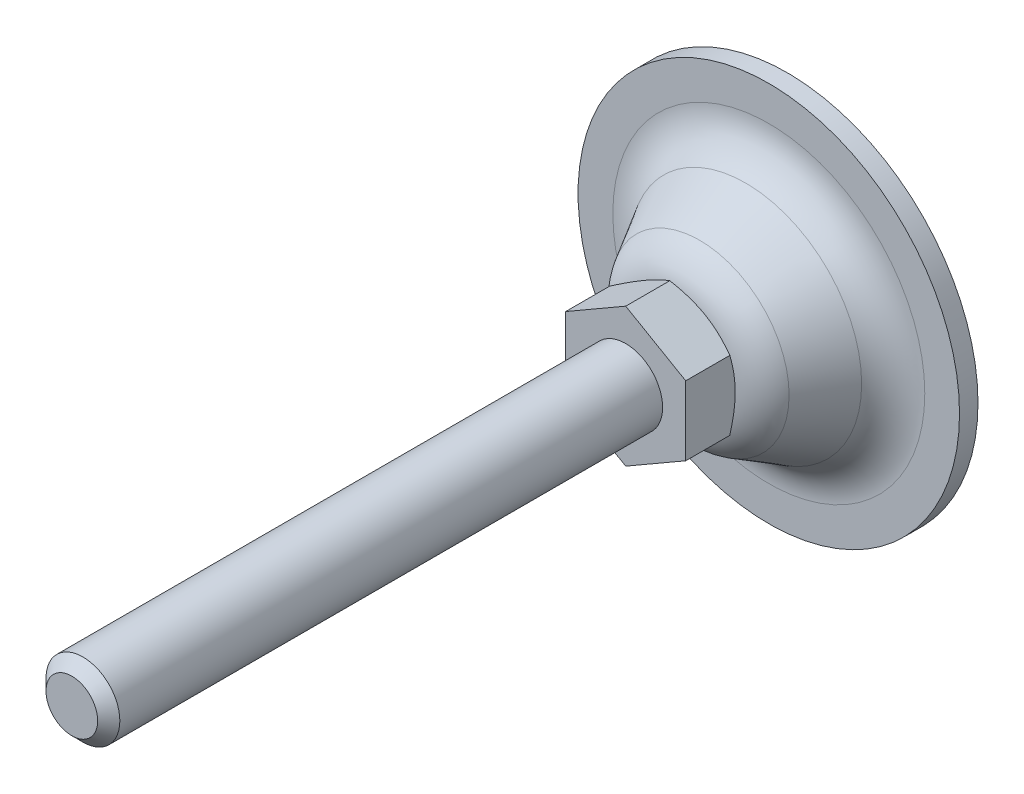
ISO-10303-21;
HEADER;
FILE_DESCRIPTION(('STEP AP214'),'2;1');
FILE_NAME('part.step','',(''),(''),'','','');
FILE_SCHEMA(('AUTOMOTIVE_DESIGN { 1 0 10303 214 1 1 1 1 }'));
ENDSEC;
DATA;
#1=APPLICATION_CONTEXT('core data for automotive mechanical design processes');
#2=APPLICATION_PROTOCOL_DEFINITION('international standard','automotive_design',2000,#1);
#3=PRODUCT_CONTEXT('',#1,'mechanical');
#4=PRODUCT('Part','Part','',(#3));
#5=PRODUCT_RELATED_PRODUCT_CATEGORY('part','',(#4));
#6=PRODUCT_DEFINITION_FORMATION('','',#4);
#7=PRODUCT_DEFINITION_CONTEXT('part definition',#1,'design');
#8=PRODUCT_DEFINITION('design','',#6,#7);
#9=PRODUCT_DEFINITION_SHAPE('','',#8);
#10=(LENGTH_UNIT() NAMED_UNIT(*) SI_UNIT(.MILLI.,.METRE.));
#11=(NAMED_UNIT(*) PLANE_ANGLE_UNIT() SI_UNIT($,.RADIAN.));
#12=(NAMED_UNIT(*) SI_UNIT($,.STERADIAN.) SOLID_ANGLE_UNIT());
#13=UNCERTAINTY_MEASURE_WITH_UNIT(LENGTH_MEASURE(1.E-05),#10,'distance_accuracy_value','');
#14=(GEOMETRIC_REPRESENTATION_CONTEXT(3) GLOBAL_UNCERTAINTY_ASSIGNED_CONTEXT((#13)) GLOBAL_UNIT_ASSIGNED_CONTEXT((#10,
#11,#12)) REPRESENTATION_CONTEXT('',''));
#15=CARTESIAN_POINT('',(0.,0.,0.));
#16=DIRECTION('',(0.,0.,1.));
#17=DIRECTION('',(1.,0.,0.));
#18=AXIS2_PLACEMENT_3D('',#15,#16,#17);
#19=CARTESIAN_POINT('',(0.,0.,6.9999991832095));
#20=DIRECTION('',(0.,0.,1.));
#21=DIRECTION('',(1.,0.,0.));
#22=AXIS2_PLACEMENT_3D('',#19,#20,#21);
#23=TOROIDAL_SURFACE('',#22,16.8976413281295,5.);
#24=CARTESIAN_POINT('',(0.,0.,4.50616938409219));
#25=DIRECTION('',(0.,0.,1.));
#26=DIRECTION('',(1.,0.,0.));
#27=AXIS2_PLACEMENT_3D('',#24,#25,#26);
#28=CIRCLE('',#27,12.5639577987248);
#29=CARTESIAN_POINT('',(12.5639577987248,0.,4.50616938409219));
#30=VERTEX_POINT('',#29);
#31=EDGE_CURVE('E105',#30,#30,#28,.T.);
#32=ORIENTED_EDGE('',*,*,#31,.F.);
#33=EDGE_LOOP('',(#32));
#34=FACE_BOUND('',#33,.T.);
#35=CARTESIAN_POINT('',(0.,0.,2.));
#36=DIRECTION('',(0.,0.,1.));
#37=DIRECTION('',(1.,0.,0.));
#38=AXIS2_PLACEMENT_3D('',#35,#36,#37);
#39=CIRCLE('',#38,16.8976408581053);
#40=CARTESIAN_POINT('',(16.8976408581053,0.,2.));
#41=VERTEX_POINT('',#40);
#42=EDGE_CURVE('E198',#41,#41,#39,.T.);
#43=ORIENTED_EDGE('',*,*,#42,.T.);
#44=EDGE_LOOP('',(#43));
#45=FACE_BOUND('',#44,.T.);
#46=ADVANCED_FACE('F14',(#34,#45),#23,.F.);
#47=CARTESIAN_POINT('',(0.,0.,17.5));
#48=DIRECTION('',(0.,0.,1.));
#49=DIRECTION('',(1.,0.,0.));
#50=AXIS2_PLACEMENT_3D('',#47,#48,#49);
#51=PLANE('',#50);
#52=DIRECTION('',(-0.866025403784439,0.5,0.));
#53=VECTOR('',#52,1.);
#54=CARTESIAN_POINT('',(6.5,3.75277674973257,17.5));
#55=LINE('',#54,#53);
#56=CARTESIAN_POINT('',(6.5,3.75277674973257,17.5));
#57=VERTEX_POINT('',#56);
#58=CARTESIAN_POINT('',(0.,7.50555349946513,17.5));
#59=VERTEX_POINT('',#58);
#60=EDGE_CURVE('E371',#57,#59,#55,.T.);
#61=ORIENTED_EDGE('',*,*,#60,.T.);
#62=DIRECTION('',(-0.866025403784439,-0.5,0.));
#63=VECTOR('',#62,1.);
#64=CARTESIAN_POINT('',(0.,7.50555349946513,17.5));
#65=LINE('',#64,#63);
#66=CARTESIAN_POINT('',(-6.5,3.75277674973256,17.5));
#67=VERTEX_POINT('',#66);
#68=EDGE_CURVE('E368',#59,#67,#65,.T.);
#69=ORIENTED_EDGE('',*,*,#68,.T.);
#70=DIRECTION('',(0.,-1.,0.));
#71=VECTOR('',#70,1.);
#72=CARTESIAN_POINT('',(-6.5,3.75277674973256,17.5));
#73=LINE('',#72,#71);
#74=CARTESIAN_POINT('',(-6.5,-3.75277674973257,17.5));
#75=VERTEX_POINT('',#74);
#76=EDGE_CURVE('E367',#67,#75,#73,.T.);
#77=ORIENTED_EDGE('',*,*,#76,.T.);
#78=DIRECTION('',(0.866025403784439,-0.5,0.));
#79=VECTOR('',#78,1.);
#80=CARTESIAN_POINT('',(-6.5,-3.75277674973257,17.5));
#81=LINE('',#80,#79);
#82=CARTESIAN_POINT('',(0.,-7.50555349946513,17.5));
#83=VERTEX_POINT('',#82);
#84=EDGE_CURVE('E375',#75,#83,#81,.T.);
#85=ORIENTED_EDGE('',*,*,#84,.T.);
#86=DIRECTION('',(0.866025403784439,0.5,0.));
#87=VECTOR('',#86,1.);
#88=CARTESIAN_POINT('',(0.,-7.50555349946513,17.5));
#89=LINE('',#88,#87);
#90=CARTESIAN_POINT('',(6.5,-3.75277674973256,17.5));
#91=VERTEX_POINT('',#90);
#92=EDGE_CURVE('E377',#83,#91,#89,.T.);
#93=ORIENTED_EDGE('',*,*,#92,.T.);
#94=DIRECTION('',(0.,1.,0.));
#95=VECTOR('',#94,1.);
#96=CARTESIAN_POINT('',(6.5,-3.75277674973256,17.5));
#97=LINE('',#96,#95);
#98=EDGE_CURVE('E37',#91,#57,#97,.T.);
#99=ORIENTED_EDGE('',*,*,#98,.T.);
#100=EDGE_LOOP('',(#61,#69,#77,#85,#93,#99));
#101=FACE_BOUND('',#100,.T.);
#102=CARTESIAN_POINT('',(0.,0.,17.5));
#103=DIRECTION('',(0.,0.,1.));
#104=DIRECTION('',(1.,0.,0.));
#105=AXIS2_PLACEMENT_3D('',#102,#103,#104);
#106=CIRCLE('',#105,4.);
#107=CARTESIAN_POINT('',(4.,0.,17.5));
#108=VERTEX_POINT('',#107);
#109=EDGE_CURVE('E208',#108,#108,#106,.T.);
#110=ORIENTED_EDGE('',*,*,#109,.F.);
#111=EDGE_LOOP('',(#110));
#112=FACE_BOUND('',#111,.T.);
#113=ADVANCED_FACE('F126',(#101,#112),#51,.T.);
#114=CARTESIAN_POINT('',(0.,0.,7.));
#115=DIRECTION('',(0.,0.,1.));
#116=DIRECTION('',(1.,0.,0.));
#117=AXIS2_PLACEMENT_3D('',#114,#115,#116);
#118=TOROIDAL_SURFACE('',#117,5.36011171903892,5.);
#119=CARTESIAN_POINT('',(0.,0.,12.));
#120=DIRECTION('',(0.,0.,1.));
#121=DIRECTION('',(1.,0.,0.));
#122=AXIS2_PLACEMENT_3D('',#119,#120,#121);
#123=CIRCLE('',#122,5.36011171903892);
#124=CARTESIAN_POINT('',(5.36011171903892,0.,12.));
#125=VERTEX_POINT('',#124);
#126=EDGE_CURVE('E73',#125,#125,#123,.T.);
#127=ORIENTED_EDGE('',*,*,#126,.F.);
#128=EDGE_LOOP('',(#127));
#129=FACE_BOUND('',#128,.T.);
#130=CARTESIAN_POINT('',(0.,0.,9.49382979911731));
#131=DIRECTION('',(0.,0.,1.));
#132=DIRECTION('',(1.,0.,0.));
#133=AXIS2_PLACEMENT_3D('',#130,#131,#132);
#134=CIRCLE('',#133,9.69379524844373);
#135=CARTESIAN_POINT('',(9.69379524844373,0.,9.49382979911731));
#136=VERTEX_POINT('',#135);
#137=EDGE_CURVE('E102',#136,#136,#134,.T.);
#138=ORIENTED_EDGE('',*,*,#137,.T.);
#139=EDGE_LOOP('',(#138));
#140=FACE_BOUND('',#139,.T.);
#141=ADVANCED_FACE('F179',(#129,#140),#118,.T.);
#142=CARTESIAN_POINT('',(0.,0.,4.50616938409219));
#143=DIRECTION('',(0.,0.,-1.));
#144=DIRECTION('',(-1.,0.,0.));
#145=AXIS2_PLACEMENT_3D('',#142,#143,#144);
#146=CONICAL_SURFACE('',#145,12.5639577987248,0.522174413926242);
#147=ORIENTED_EDGE('',*,*,#137,.F.);
#148=EDGE_LOOP('',(#147));
#149=FACE_BOUND('',#148,.T.);
#150=ORIENTED_EDGE('',*,*,#31,.T.);
#151=EDGE_LOOP('',(#150));
#152=FACE_BOUND('',#151,.T.);
#153=ADVANCED_FACE('F176',(#149,#152),#146,.T.);
#154=CARTESIAN_POINT('',(0.,0.,12.));
#155=DIRECTION('',(0.,0.,1.));
#156=DIRECTION('',(1.,0.,0.));
#157=AXIS2_PLACEMENT_3D('',#154,#155,#156);
#158=PLANE('',#157);
#159=CARTESIAN_POINT('',(0.,0.,12.));
#160=DIRECTION('',(0.,0.,-1.));
#161=DIRECTION('',(-1.,0.,0.));
#162=AXIS2_PLACEMENT_3D('',#159,#160,#161);
#163=CIRCLE('',#162,6.25);
#164=CARTESIAN_POINT('',(-6.25,0.,12.));
#165=VERTEX_POINT('',#164);
#166=EDGE_CURVE('E84',#165,#165,#163,.T.);
#167=ORIENTED_EDGE('',*,*,#166,.T.);
#168=EDGE_LOOP('',(#167));
#169=FACE_BOUND('',#168,.T.);
#170=ORIENTED_EDGE('',*,*,#126,.T.);
#171=EDGE_LOOP('',(#170));
#172=FACE_BOUND('',#171,.T.);
#173=ADVANCED_FACE('F122',(#169,#172),#158,.F.);
#174=CARTESIAN_POINT('',(0.,0.,13.5200682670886));
#175=DIRECTION('',(0.,0.,1.));
#176=DIRECTION('',(1.,0.,0.));
#177=AXIS2_PLACEMENT_3D('',#174,#175,#176);
#178=CONICAL_SURFACE('',#177,8.88283546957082,1.0471975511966);
#179=ORIENTED_EDGE('',*,*,#166,.F.);
#180=EDGE_LOOP('',(#179));
#181=FACE_BOUND('',#180,.T.);
#182=CARTESIAN_POINT('',(6.5,-10.0434732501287,15.298594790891));
#183=CARTESIAN_POINT('',(6.5,-9.75988168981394,15.1611764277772));
#184=CARTESIAN_POINT('',(6.5,-9.47563513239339,15.0250864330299));
#185=CARTESIAN_POINT('',(6.5,-8.90548356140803,14.7563110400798));
#186=CARTESIAN_POINT('',(6.5,-8.61957829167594,14.6236261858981));
#187=CARTESIAN_POINT('',(6.5,-8.04426997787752,14.3617334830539));
#188=CARTESIAN_POINT('',(6.5,-7.75485634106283,14.2325488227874));
#189=CARTESIAN_POINT('',(6.5,-7.17371415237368,13.9795158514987));
#190=CARTESIAN_POINT('',(6.5,-6.88198571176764,13.8556672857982));
#191=CARTESIAN_POINT('',(6.5,-6.28648044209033,13.6109066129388));
#192=CARTESIAN_POINT('',(6.5,-5.98261416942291,13.4902109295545));
#193=CARTESIAN_POINT('',(6.5,-5.37131267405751,13.2580441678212));
#194=CARTESIAN_POINT('',(6.5,-5.06387705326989,13.1465741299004));
#195=CARTESIAN_POINT('',(6.5,-4.44553642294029,12.93581171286));
#196=CARTESIAN_POINT('',(6.5,-4.13464001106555,12.8364943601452));
#197=CARTESIAN_POINT('',(6.5,-3.50838462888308,12.6532497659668));
#198=CARTESIAN_POINT('',(6.5,-3.19302710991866,12.569317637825));
#199=CARTESIAN_POINT('',(6.5,-2.55942759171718,12.4213357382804));
#200=CARTESIAN_POINT('',(6.5,-2.24121082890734,12.3571796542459));
#201=CARTESIAN_POINT('',(6.5,-1.60081424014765,12.2524174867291));
#202=CARTESIAN_POINT('',(6.5,-1.27863478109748,12.2118092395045));
#203=CARTESIAN_POINT('',(6.5,-0.795814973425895,12.1712550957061));
#204=CARTESIAN_POINT('',(6.5,-0.635988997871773,12.1611313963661));
#205=CARTESIAN_POINT('',(6.5,-0.31604514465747,12.1476434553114));
#206=CARTESIAN_POINT('',(6.5,-0.155927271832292,12.1442791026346));
#207=CARTESIAN_POINT('',(6.5,0.164305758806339,12.1443975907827));
#208=CARTESIAN_POINT('',(6.5,0.324420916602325,12.1478804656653));
#209=CARTESIAN_POINT('',(6.5,0.644363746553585,12.1616069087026));
#210=CARTESIAN_POINT('',(6.5,0.804191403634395,12.17185082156));
#211=CARTESIAN_POINT('',(6.5,1.1894313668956,12.2044757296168));
#212=CARTESIAN_POINT('',(6.5,1.41457236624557,12.2301273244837));
#213=CARTESIAN_POINT('',(6.5,1.86314847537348,12.2934390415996));
#214=CARTESIAN_POINT('',(6.5,2.08658334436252,12.3311008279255));
#215=CARTESIAN_POINT('',(6.5,2.75409272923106,12.4601015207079));
#216=CARTESIAN_POINT('',(6.5,3.19511583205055,12.5674312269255));
#217=CARTESIAN_POINT('',(6.5,3.85451768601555,12.7531116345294));
#218=CARTESIAN_POINT('',(6.5,4.07632766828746,12.8199741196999));
#219=CARTESIAN_POINT('',(6.5,4.51779248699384,12.9605341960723));
#220=CARTESIAN_POINT('',(6.5,4.73744730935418,13.0342318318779));
#221=CARTESIAN_POINT('',(6.49999999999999,5.17467305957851,13.1872888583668));
#222=CARTESIAN_POINT('',(6.49999999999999,5.39224467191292,13.2666463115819));
#223=CARTESIAN_POINT('',(6.5,5.82559260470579,13.4301001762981));
#224=CARTESIAN_POINT('',(6.5,6.04136894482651,13.514196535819));
#225=CARTESIAN_POINT('',(6.5,6.54500739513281,13.7158388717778));
#226=CARTESIAN_POINT('',(6.5,6.83223289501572,13.8349718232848));
#227=CARTESIAN_POINT('',(6.49999999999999,7.40429079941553,14.0788671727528));
#228=CARTESIAN_POINT('',(6.49999999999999,7.6891230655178,14.2036298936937));
#229=CARTESIAN_POINT('',(6.49999999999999,8.25682745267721,14.4576697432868));
#230=CARTESIAN_POINT('',(6.49999999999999,8.5396991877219,14.5869477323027));
#231=CARTESIAN_POINT('',(6.49999999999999,9.10376132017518,14.8491274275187));
#232=CARTESIAN_POINT('',(6.49999999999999,9.38495168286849,14.9820292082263));
#233=CARTESIAN_POINT('',(6.49999999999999,9.94620539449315,15.2509206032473));
#234=CARTESIAN_POINT('',(6.49999999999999,10.2262672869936,15.3869132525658));
#235=CARTESIAN_POINT('',(6.49999999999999,10.7851955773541,15.6613356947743));
#236=CARTESIAN_POINT('',(6.49999999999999,11.0640619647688,15.7997655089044));
#237=CARTESIAN_POINT('',(6.49999999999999,11.8990793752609,16.2180352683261));
#238=CARTESIAN_POINT('',(6.49999999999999,12.4537200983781,16.5008900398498));
#239=CARTESIAN_POINT('',(6.49999999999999,13.514594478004,17.0487944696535));
#240=CARTESIAN_POINT('',(6.49999999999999,14.0210601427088,17.3133968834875));
#241=CARTESIAN_POINT('',(6.49999999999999,15.0321061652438,17.8462176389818));
#242=CARTESIAN_POINT('',(6.49999999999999,15.536686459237,18.1144361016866));
#243=CARTESIAN_POINT('',(6.49999999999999,16.5431596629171,18.652983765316));
#244=CARTESIAN_POINT('',(6.49999999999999,17.0450561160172,18.9233063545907));
#245=CARTESIAN_POINT('',(6.49999999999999,18.0476403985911,19.4661210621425));
#246=CARTESIAN_POINT('',(6.49999999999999,18.5483282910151,19.7386130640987));
#247=CARTESIAN_POINT('',(6.5,19.0485697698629,20.0119166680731));
#248=B_SPLINE_CURVE_WITH_KNOTS('',3,(#182,#183,#184,#185,#186,#187,#188,#189,#190,#191,#192,
#193,#194,#195,#196,#197,#198,#199,#200,#201,#202,#203,#204,#205,#206,#207,#208,#209,#210,#211,
#212,#213,#214,#215,#216,#217,#218,#219,#220,#221,#222,#223,#224,#225,#226,#227,#228,#229,#230,
#231,#232,#233,#234,#235,#236,#237,#238,#239,#240,#241,#242,#243,#244,#245,#246,#247),
.UNSPECIFIED.,.F.,.F.,(4,2,2,2,2,2,2,2,2,2,2,2,2,2,2,2,2,2,2,2,2,2,2,2,2,2,2,2,2,2,2,2,4),(0.,
0.945406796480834,1.89096370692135,2.84173097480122,3.79245281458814,4.77321406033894,
5.75408576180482,6.73290667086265,7.71141614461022,8.68456969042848,9.65763380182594,
10.1379514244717,10.6182611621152,11.0985732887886,11.5789099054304,12.2583181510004,
12.9378205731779,14.2975940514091,14.9925427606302,15.6874960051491,16.3822124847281,
17.0769213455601,18.0096970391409,18.94252631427,19.875534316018,20.8085615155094,
21.742548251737,22.6765431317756,24.5442948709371,26.2585421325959,27.9728469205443,
29.6830369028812,31.393135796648),.UNSPECIFIED.);
#249=CARTESIAN_POINT('',(6.5,-3.75277674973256,12.7248941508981));
#250=VERTEX_POINT('',#249);
#251=CARTESIAN_POINT('',(6.5,3.75277674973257,12.7248941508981));
#252=VERTEX_POINT('',#251);
#253=EDGE_CURVE('E65',#250,#252,#248,.T.);
#254=ORIENTED_EDGE('',*,*,#253,.F.);
#255=CARTESIAN_POINT('',(-0.000199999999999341,-7.50566896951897,12.7249608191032));
#256=CARTESIAN_POINT('',(0.142677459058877,-7.4231786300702,12.6773419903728));
#257=CARTESIAN_POINT('',(0.286087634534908,-7.34038072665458,12.6318842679));
#258=CARTESIAN_POINT('',(0.574072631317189,-7.17411251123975,12.5458862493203));
#259=CARTESIAN_POINT('',(0.71864792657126,-7.09064192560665,12.5053480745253));
#260=CARTESIAN_POINT('',(1.15468865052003,-6.83889369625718,12.3919085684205));
#261=CARTESIAN_POINT('',(1.44787528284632,-6.6696223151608,12.327385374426));
#262=CARTESIAN_POINT('',(1.88662374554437,-6.41631077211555,12.2517241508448));
#263=CARTESIAN_POINT('',(2.03087463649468,-6.33302748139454,12.2301704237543));
#264=CARTESIAN_POINT('',(2.32002821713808,-6.16608458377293,12.1940278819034));
#265=CARTESIAN_POINT('',(2.46493084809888,-6.08242501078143,12.179438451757));
#266=CARTESIAN_POINT('',(2.75498777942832,-5.91496056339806,12.1575963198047));
#267=CARTESIAN_POINT('',(2.90014160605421,-5.8311559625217,12.1503352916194));
#268=CARTESIAN_POINT('',(3.19057533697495,-5.66347396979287,12.1432978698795));
#269=CARTESIAN_POINT('',(3.33585523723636,-5.5795965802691,12.1435212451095));
#270=CARTESIAN_POINT('',(3.73387594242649,-5.34979921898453,12.1544210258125));
#271=CARTESIAN_POINT('',(3.98648646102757,-5.20395446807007,12.1727193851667));
#272=CARTESIAN_POINT('',(4.49002967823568,-4.91323365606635,12.230743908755));
#273=CARTESIAN_POINT('',(4.74096060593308,-4.76835861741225,12.2704899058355));
#274=CARTESIAN_POINT('',(5.24551722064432,-4.47705272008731,12.3698434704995));
#275=CARTESIAN_POINT('',(5.49907924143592,-4.33065861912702,12.4298719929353));
#276=CARTESIAN_POINT('',(6.00242193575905,-4.04005357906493,12.5661125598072));
#277=CARTESIAN_POINT('',(6.25220905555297,-3.89583891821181,12.6422926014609));
#278=CARTESIAN_POINT('',(6.5002,-3.75266127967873,12.7249608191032));
#279=B_SPLINE_CURVE_WITH_KNOTS('',3,(#255,#256,#257,#258,#259,#260,#261,#262,#263,#264,#265,
#266,#267,#268,#269,#270,#271,#272,#273,#274,#275,#276,#277,#278),.UNSPECIFIED.,.F.,.F.,(4,2,2,
2,2,2,2,2,2,2,2,4),(0.,0.51510505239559,1.03043143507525,2.06322554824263,2.56697389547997,
3.07067772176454,3.57380860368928,4.07692394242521,4.95279354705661,5.82947446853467,
6.72559912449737,7.61996451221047),.UNSPECIFIED.);
#280=CARTESIAN_POINT('',(0.,-7.50555349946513,12.7248941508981));
#281=VERTEX_POINT('',#280);
#282=EDGE_CURVE('E68',#281,#250,#279,.T.);
#283=ORIENTED_EDGE('',*,*,#282,.F.);
#284=CARTESIAN_POINT('',(-6.5002,-3.75266127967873,12.7249608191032));
#285=CARTESIAN_POINT('',(-6.35732254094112,-3.8351516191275,12.6773419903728));
#286=CARTESIAN_POINT('',(-6.21391236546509,-3.91794952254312,12.6318842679));
#287=CARTESIAN_POINT('',(-5.92592736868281,-4.08421773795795,12.5458862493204));
#288=CARTESIAN_POINT('',(-5.78135207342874,-4.16768832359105,12.5053480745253));
#289=CARTESIAN_POINT('',(-5.34531134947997,-4.41943655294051,12.3919085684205));
#290=CARTESIAN_POINT('',(-5.05212471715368,-4.5887079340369,12.327385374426));
#291=CARTESIAN_POINT('',(-4.61337625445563,-4.84201947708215,12.2517241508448));
#292=CARTESIAN_POINT('',(-4.46912536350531,-4.92530276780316,12.2301704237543));
#293=CARTESIAN_POINT('',(-4.17997178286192,-5.09224566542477,12.1940278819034));
#294=CARTESIAN_POINT('',(-4.03506915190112,-5.17590523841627,12.179438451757));
#295=CARTESIAN_POINT('',(-3.74501222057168,-5.34336968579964,12.1575963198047));
#296=CARTESIAN_POINT('',(-3.59985839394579,-5.427174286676,12.1503352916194));
#297=CARTESIAN_POINT('',(-3.30942466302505,-5.59485627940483,12.1432978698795));
#298=CARTESIAN_POINT('',(-3.16414476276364,-5.6787336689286,12.1435212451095));
#299=CARTESIAN_POINT('',(-2.76612405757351,-5.90853103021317,12.1544210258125));
#300=CARTESIAN_POINT('',(-2.51351353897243,-6.05437578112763,12.1727193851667));
#301=CARTESIAN_POINT('',(-2.00997032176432,-6.34509659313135,12.230743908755));
#302=CARTESIAN_POINT('',(-1.75903939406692,-6.48997163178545,12.2704899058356));
#303=CARTESIAN_POINT('',(-1.25448277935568,-6.78127752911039,12.3698434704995));
#304=CARTESIAN_POINT('',(-1.00092075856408,-6.92767163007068,12.4298719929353));
#305=CARTESIAN_POINT('',(-0.497578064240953,-7.21827667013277,12.5661125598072));
#306=CARTESIAN_POINT('',(-0.247790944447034,-7.36249133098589,12.6422926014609));
#307=CARTESIAN_POINT('',(0.000200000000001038,-7.50566896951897,12.7249608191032));
#308=B_SPLINE_CURVE_WITH_KNOTS('',3,(#284,#285,#286,#287,#288,#289,#290,#291,#292,#293,#294,
#295,#296,#297,#298,#299,#300,#301,#302,#303,#304,#305,#306,#307),.UNSPECIFIED.,.F.,.F.,(4,2,2,
2,2,2,2,2,2,2,2,4),(0.,0.51510505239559,1.03043143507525,2.06322554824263,2.56697389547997,
3.07067772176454,3.57380860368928,4.07692394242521,4.95279354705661,5.82947446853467,
6.72559912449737,7.61996451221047),.UNSPECIFIED.);
#309=CARTESIAN_POINT('',(-6.5,-3.75277674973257,12.7248941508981));
#310=VERTEX_POINT('',#309);
#311=EDGE_CURVE('E83',#310,#281,#308,.T.);
#312=ORIENTED_EDGE('',*,*,#311,.F.);
#313=CARTESIAN_POINT('',(-6.5,-10.0434732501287,15.298594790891));
#314=CARTESIAN_POINT('',(-6.5,-9.75988168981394,15.1611764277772));
#315=CARTESIAN_POINT('',(-6.5,-9.47563513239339,15.0250864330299));
#316=CARTESIAN_POINT('',(-6.49999999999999,-8.90548356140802,14.7563110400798));
#317=CARTESIAN_POINT('',(-6.5,-8.61957829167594,14.6236261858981));
#318=CARTESIAN_POINT('',(-6.5,-8.04426997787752,14.3617334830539));
#319=CARTESIAN_POINT('',(-6.5,-7.75485634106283,14.2325488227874));
#320=CARTESIAN_POINT('',(-6.5,-7.17371415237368,13.9795158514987));
#321=CARTESIAN_POINT('',(-6.5,-6.88198571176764,13.8556672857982));
#322=CARTESIAN_POINT('',(-6.5,-6.28648044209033,13.6109066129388));
#323=CARTESIAN_POINT('',(-6.5,-5.98261416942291,13.4902109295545));
#324=CARTESIAN_POINT('',(-6.5,-5.37131267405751,13.2580441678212));
#325=CARTESIAN_POINT('',(-6.5,-5.06387705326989,13.1465741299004));
#326=CARTESIAN_POINT('',(-6.5,-4.44553642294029,12.93581171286));
#327=CARTESIAN_POINT('',(-6.5,-4.13464001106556,12.8364943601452));
#328=CARTESIAN_POINT('',(-6.5,-3.50838462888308,12.6532497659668));
#329=CARTESIAN_POINT('',(-6.5,-3.19302710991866,12.569317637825));
#330=CARTESIAN_POINT('',(-6.5,-2.55942759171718,12.4213357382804));
#331=CARTESIAN_POINT('',(-6.5,-2.24121082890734,12.3571796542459));
#332=CARTESIAN_POINT('',(-6.5,-1.60081424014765,12.2524174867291));
#333=CARTESIAN_POINT('',(-6.5,-1.27863478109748,12.2118092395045));
#334=CARTESIAN_POINT('',(-6.5,-0.795814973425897,12.1712550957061));
#335=CARTESIAN_POINT('',(-6.5,-0.635988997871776,12.1611313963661));
#336=CARTESIAN_POINT('',(-6.5,-0.316045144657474,12.1476434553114));
#337=CARTESIAN_POINT('',(-6.5,-0.155927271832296,12.1442791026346));
#338=CARTESIAN_POINT('',(-6.5,0.164305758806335,12.1443975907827));
#339=CARTESIAN_POINT('',(-6.5,0.324420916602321,12.1478804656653));
#340=CARTESIAN_POINT('',(-6.5,0.644363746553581,12.1616069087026));
#341=CARTESIAN_POINT('',(-6.5,0.804191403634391,12.17185082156));
#342=CARTESIAN_POINT('',(-6.5,1.1894313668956,12.2044757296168));
#343=CARTESIAN_POINT('',(-6.5,1.41457236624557,12.2301273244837));
#344=CARTESIAN_POINT('',(-6.5,1.86314847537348,12.2934390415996));
#345=CARTESIAN_POINT('',(-6.5,2.08658334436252,12.3311008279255));
#346=CARTESIAN_POINT('',(-6.5,2.75409272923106,12.4601015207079));
#347=CARTESIAN_POINT('',(-6.5,3.19511583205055,12.5674312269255));
#348=CARTESIAN_POINT('',(-6.5,3.85451768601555,12.7531116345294));
#349=CARTESIAN_POINT('',(-6.5,4.07632766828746,12.8199741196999));
#350=CARTESIAN_POINT('',(-6.5,4.51779248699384,12.9605341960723));
#351=CARTESIAN_POINT('',(-6.5,4.73744730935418,13.0342318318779));
#352=CARTESIAN_POINT('',(-6.5,5.17467305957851,13.1872888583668));
#353=CARTESIAN_POINT('',(-6.5,5.39224467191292,13.2666463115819));
#354=CARTESIAN_POINT('',(-6.5,5.82559260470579,13.4301001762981));
#355=CARTESIAN_POINT('',(-6.5,6.04136894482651,13.514196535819));
#356=CARTESIAN_POINT('',(-6.5,6.54500739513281,13.7158388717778));
#357=CARTESIAN_POINT('',(-6.5,6.83223289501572,13.8349718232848));
#358=CARTESIAN_POINT('',(-6.5,7.40429079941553,14.0788671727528));
#359=CARTESIAN_POINT('',(-6.5,7.6891230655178,14.2036298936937));
#360=CARTESIAN_POINT('',(-6.5,8.25682745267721,14.4576697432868));
#361=CARTESIAN_POINT('',(-6.5,8.5396991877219,14.5869477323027));
#362=CARTESIAN_POINT('',(-6.5,9.10376132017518,14.8491274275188));
#363=CARTESIAN_POINT('',(-6.5,9.38495168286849,14.9820292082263));
#364=CARTESIAN_POINT('',(-6.5,9.94620539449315,15.2509206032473));
#365=CARTESIAN_POINT('',(-6.5,10.2262672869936,15.3869132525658));
#366=CARTESIAN_POINT('',(-6.5,10.7851955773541,15.6613356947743));
#367=CARTESIAN_POINT('',(-6.5,11.0640619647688,15.7997655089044));
#368=CARTESIAN_POINT('',(-6.5,11.8990793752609,16.2180352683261));
#369=CARTESIAN_POINT('',(-6.5,12.4537200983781,16.5008900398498));
#370=CARTESIAN_POINT('',(-6.5,13.514594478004,17.0487944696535));
#371=CARTESIAN_POINT('',(-6.5,14.0210601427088,17.3133968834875));
#372=CARTESIAN_POINT('',(-6.5,15.0321061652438,17.8462176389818));
#373=CARTESIAN_POINT('',(-6.5,15.536686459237,18.1144361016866));
#374=CARTESIAN_POINT('',(-6.50000000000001,16.5431596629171,18.652983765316));
#375=CARTESIAN_POINT('',(-6.50000000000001,17.0450561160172,18.9233063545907));
#376=CARTESIAN_POINT('',(-6.50000000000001,18.0476403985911,19.4661210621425));
#377=CARTESIAN_POINT('',(-6.5,18.5483282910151,19.7386130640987));
#378=CARTESIAN_POINT('',(-6.5,19.0485697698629,20.0119166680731));
#379=B_SPLINE_CURVE_WITH_KNOTS('',3,(#313,#314,#315,#316,#317,#318,#319,#320,#321,#322,#323,
#324,#325,#326,#327,#328,#329,#330,#331,#332,#333,#334,#335,#336,#337,#338,#339,#340,#341,#342,
#343,#344,#345,#346,#347,#348,#349,#350,#351,#352,#353,#354,#355,#356,#357,#358,#359,#360,#361,
#362,#363,#364,#365,#366,#367,#368,#369,#370,#371,#372,#373,#374,#375,#376,#377,#378),
.UNSPECIFIED.,.F.,.F.,(4,2,2,2,2,2,2,2,2,2,2,2,2,2,2,2,2,2,2,2,2,2,2,2,2,2,2,2,2,2,2,2,4),(0.,
0.945406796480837,1.89096370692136,2.84173097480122,3.79245281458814,4.77321406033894,
5.75408576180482,6.73290667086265,7.71141614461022,8.68456969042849,9.65763380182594,
10.1379514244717,10.6182611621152,11.0985732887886,11.5789099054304,12.2583181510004,
12.9378205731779,14.2975940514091,14.9925427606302,15.6874960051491,16.3822124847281,
17.0769213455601,18.0096970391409,18.94252631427,19.875534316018,20.8085615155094,
21.742548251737,22.6765431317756,24.5442948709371,26.2585421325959,27.9728469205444,
29.6830369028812,31.3931357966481),.UNSPECIFIED.);
#380=CARTESIAN_POINT('',(-6.5,3.75277674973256,12.7248941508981));
#381=VERTEX_POINT('',#380);
#382=EDGE_CURVE('E145',#381,#310,#379,.F.);
#383=ORIENTED_EDGE('',*,*,#382,.F.);
#384=CARTESIAN_POINT('',(0.000199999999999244,7.50566896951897,12.7249608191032));
#385=CARTESIAN_POINT('',(-0.142677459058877,7.4231786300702,12.6773419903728));
#386=CARTESIAN_POINT('',(-0.286087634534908,7.34038072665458,12.6318842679));
#387=CARTESIAN_POINT('',(-0.57407263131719,7.17411251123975,12.5458862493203));
#388=CARTESIAN_POINT('',(-0.71864792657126,7.09064192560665,12.5053480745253));
#389=CARTESIAN_POINT('',(-1.15468865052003,6.83889369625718,12.3919085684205));
#390=CARTESIAN_POINT('',(-1.44787528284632,6.6696223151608,12.327385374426));
#391=CARTESIAN_POINT('',(-1.88662374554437,6.41631077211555,12.2517241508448));
#392=CARTESIAN_POINT('',(-2.03087463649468,6.33302748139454,12.2301704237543));
#393=CARTESIAN_POINT('',(-2.32002821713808,6.16608458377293,12.1940278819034));
#394=CARTESIAN_POINT('',(-2.46493084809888,6.08242501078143,12.179438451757));
#395=CARTESIAN_POINT('',(-2.75498777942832,5.91496056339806,12.1575963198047));
#396=CARTESIAN_POINT('',(-2.90014160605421,5.8311559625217,12.1503352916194));
#397=CARTESIAN_POINT('',(-3.19057533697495,5.66347396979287,12.1432978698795));
#398=CARTESIAN_POINT('',(-3.33585523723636,5.5795965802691,12.1435212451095));
#399=CARTESIAN_POINT('',(-3.73387594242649,5.34979921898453,12.1544210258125));
#400=CARTESIAN_POINT('',(-3.98648646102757,5.20395446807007,12.1727193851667));
#401=CARTESIAN_POINT('',(-4.49002967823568,4.91323365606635,12.230743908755));
#402=CARTESIAN_POINT('',(-4.74096060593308,4.76835861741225,12.2704899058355));
#403=CARTESIAN_POINT('',(-5.24551722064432,4.47705272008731,12.3698434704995));
#404=CARTESIAN_POINT('',(-5.49907924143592,4.33065861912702,12.4298719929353));
#405=CARTESIAN_POINT('',(-6.00242193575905,4.04005357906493,12.5661125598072));
#406=CARTESIAN_POINT('',(-6.25220905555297,3.89583891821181,12.6422926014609));
#407=CARTESIAN_POINT('',(-6.5002,3.75266127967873,12.7249608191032));
#408=B_SPLINE_CURVE_WITH_KNOTS('',3,(#384,#385,#386,#387,#388,#389,#390,#391,#392,#393,#394,
#395,#396,#397,#398,#399,#400,#401,#402,#403,#404,#405,#406,#407),.UNSPECIFIED.,.F.,.F.,(4,2,2,
2,2,2,2,2,2,2,2,4),(0.,0.51510505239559,1.03043143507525,2.06322554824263,2.56697389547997,
3.07067772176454,3.57380860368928,4.07692394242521,4.95279354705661,5.82947446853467,
6.72559912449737,7.61996451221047),.UNSPECIFIED.);
#409=CARTESIAN_POINT('',(0.,7.50555349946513,12.7248941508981));
#410=VERTEX_POINT('',#409);
#411=EDGE_CURVE('E152',#410,#381,#408,.T.);
#412=ORIENTED_EDGE('',*,*,#411,.F.);
#413=CARTESIAN_POINT('',(6.5002,3.75266127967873,12.7249608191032));
#414=CARTESIAN_POINT('',(6.35732254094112,3.83515161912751,12.6773419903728));
#415=CARTESIAN_POINT('',(6.21391236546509,3.91794952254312,12.6318842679));
#416=CARTESIAN_POINT('',(5.92592736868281,4.08421773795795,12.5458862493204));
#417=CARTESIAN_POINT('',(5.78135207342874,4.16768832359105,12.5053480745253));
#418=CARTESIAN_POINT('',(5.34531134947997,4.41943655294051,12.3919085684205));
#419=CARTESIAN_POINT('',(5.05212471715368,4.5887079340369,12.327385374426));
#420=CARTESIAN_POINT('',(4.61337625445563,4.84201947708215,12.2517241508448));
#421=CARTESIAN_POINT('',(4.46912536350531,4.92530276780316,12.2301704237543));
#422=CARTESIAN_POINT('',(4.17997178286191,5.09224566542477,12.1940278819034));
#423=CARTESIAN_POINT('',(4.03506915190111,5.17590523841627,12.179438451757));
#424=CARTESIAN_POINT('',(3.74501222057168,5.34336968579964,12.1575963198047));
#425=CARTESIAN_POINT('',(3.59985839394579,5.427174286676,12.1503352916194));
#426=CARTESIAN_POINT('',(3.30942466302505,5.59485627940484,12.1432978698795));
#427=CARTESIAN_POINT('',(3.16414476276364,5.6787336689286,12.1435212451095));
#428=CARTESIAN_POINT('',(2.7661240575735,5.90853103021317,12.1544210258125));
#429=CARTESIAN_POINT('',(2.51351353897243,6.05437578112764,12.1727193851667));
#430=CARTESIAN_POINT('',(2.00997032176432,6.34509659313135,12.230743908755));
#431=CARTESIAN_POINT('',(1.75903939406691,6.48997163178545,12.2704899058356));
#432=CARTESIAN_POINT('',(1.25448277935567,6.78127752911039,12.3698434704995));
#433=CARTESIAN_POINT('',(1.00092075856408,6.92767163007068,12.4298719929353));
#434=CARTESIAN_POINT('',(0.497578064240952,7.21827667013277,12.5661125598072));
#435=CARTESIAN_POINT('',(0.247790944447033,7.36249133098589,12.6422926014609));
#436=CARTESIAN_POINT('',(-0.000200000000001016,7.50566896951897,12.7249608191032));
#437=B_SPLINE_CURVE_WITH_KNOTS('',3,(#413,#414,#415,#416,#417,#418,#419,#420,#421,#422,#423,
#424,#425,#426,#427,#428,#429,#430,#431,#432,#433,#434,#435,#436),.UNSPECIFIED.,.F.,.F.,(4,2,2,
2,2,2,2,2,2,2,2,4),(0.,0.51510505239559,1.03043143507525,2.06322554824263,2.56697389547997,
3.07067772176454,3.57380860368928,4.07692394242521,4.95279354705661,5.82947446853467,
6.72559912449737,7.61996451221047),.UNSPECIFIED.);
#438=EDGE_CURVE('E29',#252,#410,#437,.T.);
#439=ORIENTED_EDGE('',*,*,#438,.F.);
#440=EDGE_LOOP('',(#254,#283,#312,#383,#412,#439));
#441=FACE_BOUND('',#440,.T.);
#442=ADVANCED_FACE('F67',(#181,#441),#178,.T.);
#443=CARTESIAN_POINT('',(6.5,-3.75277674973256,17.5));
#444=DIRECTION('',(-1.,0.,0.));
#445=DIRECTION('',(0.,-1.,0.));
#446=AXIS2_PLACEMENT_3D('',#443,#444,#445);
#447=PLANE('',#446);
#448=DIRECTION('',(0.,0.,-1.));
#449=VECTOR('',#448,1.);
#450=CARTESIAN_POINT('',(6.5,-3.75277674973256,17.5));
#451=LINE('',#450,#449);
#452=EDGE_CURVE('E80',#91,#250,#451,.T.);
#453=ORIENTED_EDGE('',*,*,#452,.T.);
#454=ORIENTED_EDGE('',*,*,#253,.T.);
#455=DIRECTION('',(0.,0.,-1.));
#456=VECTOR('',#455,1.);
#457=CARTESIAN_POINT('',(6.5,3.75277674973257,17.5));
#458=LINE('',#457,#456);
#459=EDGE_CURVE('E87',#57,#252,#458,.T.);
#460=ORIENTED_EDGE('',*,*,#459,.F.);
#461=ORIENTED_EDGE('',*,*,#98,.F.);
#462=EDGE_LOOP('',(#453,#454,#460,#461));
#463=FACE_BOUND('',#462,.T.);
#464=ADVANCED_FACE('F86',(#463),#447,.F.);
#465=CARTESIAN_POINT('',(0.,-7.50555349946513,17.5));
#466=DIRECTION('',(-0.5,0.866025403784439,0.));
#467=DIRECTION('',(-0.866025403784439,-0.5,0.));
#468=AXIS2_PLACEMENT_3D('',#465,#466,#467);
#469=PLANE('',#468);
#470=DIRECTION('',(0.,0.,-1.));
#471=VECTOR('',#470,1.);
#472=CARTESIAN_POINT('',(0.,-7.50555349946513,17.5));
#473=LINE('',#472,#471);
#474=EDGE_CURVE('E82',#83,#281,#473,.T.);
#475=ORIENTED_EDGE('',*,*,#474,.T.);
#476=ORIENTED_EDGE('',*,*,#282,.T.);
#477=ORIENTED_EDGE('',*,*,#452,.F.);
#478=ORIENTED_EDGE('',*,*,#92,.F.);
#479=EDGE_LOOP('',(#475,#476,#477,#478));
#480=FACE_BOUND('',#479,.T.);
#481=ADVANCED_FACE('F78',(#480),#469,.F.);
#482=CARTESIAN_POINT('',(-6.5,-3.75277674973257,17.5));
#483=DIRECTION('',(0.5,0.866025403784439,0.));
#484=DIRECTION('',(-0.866025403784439,0.5,0.));
#485=AXIS2_PLACEMENT_3D('',#482,#483,#484);
#486=PLANE('',#485);
#487=DIRECTION('',(0.,0.,-1.));
#488=VECTOR('',#487,1.);
#489=CARTESIAN_POINT('',(-6.5,-3.75277674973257,17.5));
#490=LINE('',#489,#488);
#491=EDGE_CURVE('E89',#75,#310,#490,.T.);
#492=ORIENTED_EDGE('',*,*,#491,.T.);
#493=ORIENTED_EDGE('',*,*,#311,.T.);
#494=ORIENTED_EDGE('',*,*,#474,.F.);
#495=ORIENTED_EDGE('',*,*,#84,.F.);
#496=EDGE_LOOP('',(#492,#493,#494,#495));
#497=FACE_BOUND('',#496,.T.);
#498=ADVANCED_FACE('F244',(#497),#486,.F.);
#499=CARTESIAN_POINT('',(-6.5,3.75277674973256,17.5));
#500=DIRECTION('',(1.,0.,0.));
#501=DIRECTION('',(0.,1.,0.));
#502=AXIS2_PLACEMENT_3D('',#499,#500,#501);
#503=PLANE('',#502);
#504=DIRECTION('',(0.,0.,-1.));
#505=VECTOR('',#504,1.);
#506=CARTESIAN_POINT('',(-6.5,3.75277674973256,17.5));
#507=LINE('',#506,#505);
#508=EDGE_CURVE('E96',#67,#381,#507,.T.);
#509=ORIENTED_EDGE('',*,*,#508,.T.);
#510=ORIENTED_EDGE('',*,*,#382,.T.);
#511=ORIENTED_EDGE('',*,*,#491,.F.);
#512=ORIENTED_EDGE('',*,*,#76,.F.);
#513=EDGE_LOOP('',(#509,#510,#511,#512));
#514=FACE_BOUND('',#513,.T.);
#515=ADVANCED_FACE('F169',(#514),#503,.F.);
#516=CARTESIAN_POINT('',(0.,7.50555349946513,17.5));
#517=DIRECTION('',(0.5,-0.866025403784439,0.));
#518=DIRECTION('',(0.866025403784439,0.5,0.));
#519=AXIS2_PLACEMENT_3D('',#516,#517,#518);
#520=PLANE('',#519);
#521=DIRECTION('',(0.,0.,-1.));
#522=VECTOR('',#521,1.);
#523=CARTESIAN_POINT('',(0.,7.50555349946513,17.5));
#524=LINE('',#523,#522);
#525=EDGE_CURVE('E99',#59,#410,#524,.T.);
#526=ORIENTED_EDGE('',*,*,#525,.T.);
#527=ORIENTED_EDGE('',*,*,#411,.T.);
#528=ORIENTED_EDGE('',*,*,#508,.F.);
#529=ORIENTED_EDGE('',*,*,#68,.F.);
#530=EDGE_LOOP('',(#526,#527,#528,#529));
#531=FACE_BOUND('',#530,.T.);
#532=ADVANCED_FACE('F165',(#531),#520,.F.);
#533=CARTESIAN_POINT('',(6.5,3.75277674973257,17.5));
#534=DIRECTION('',(-0.5,-0.866025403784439,0.));
#535=DIRECTION('',(0.866025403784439,-0.5,0.));
#536=AXIS2_PLACEMENT_3D('',#533,#534,#535);
#537=PLANE('',#536);
#538=ORIENTED_EDGE('',*,*,#459,.T.);
#539=ORIENTED_EDGE('',*,*,#438,.T.);
#540=ORIENTED_EDGE('',*,*,#525,.F.);
#541=ORIENTED_EDGE('',*,*,#60,.F.);
#542=EDGE_LOOP('',(#538,#539,#540,#541));
#543=FACE_BOUND('',#542,.T.);
#544=ADVANCED_FACE('F168',(#543),#537,.F.);
#545=CARTESIAN_POINT('',(0.,0.,77.5));
#546=DIRECTION('',(0.,0.,-1.));
#547=DIRECTION('',(-1.,0.,0.));
#548=AXIS2_PLACEMENT_3D('',#545,#546,#547);
#549=CYLINDRICAL_SURFACE('',#548,4.);
#550=CARTESIAN_POINT('',(0.,0.,76.3));
#551=DIRECTION('',(0.,0.,1.));
#552=DIRECTION('',(1.,0.,0.));
#553=AXIS2_PLACEMENT_3D('',#550,#551,#552);
#554=CIRCLE('',#553,4.);
#555=CARTESIAN_POINT('',(4.,0.,76.3));
#556=VERTEX_POINT('',#555);
#557=EDGE_CURVE('E9',#556,#556,#554,.F.);
#558=ORIENTED_EDGE('',*,*,#557,.T.);
#559=EDGE_LOOP('',(#558));
#560=FACE_BOUND('',#559,.T.);
#561=ORIENTED_EDGE('',*,*,#109,.T.);
#562=EDGE_LOOP('',(#561));
#563=FACE_BOUND('',#562,.T.);
#564=ADVANCED_FACE('F124',(#560,#563),#549,.T.);
#565=CARTESIAN_POINT('',(0.,0.,77.5));
#566=DIRECTION('',(0.,0.,1.));
#567=DIRECTION('',(1.,0.,0.));
#568=AXIS2_PLACEMENT_3D('',#565,#566,#567);
#569=PLANE('',#568);
#570=CARTESIAN_POINT('',(0.,0.,77.5));
#571=DIRECTION('',(0.,0.,1.));
#572=DIRECTION('',(1.,0.,0.));
#573=AXIS2_PLACEMENT_3D('',#570,#571,#572);
#574=CIRCLE('',#573,2.8);
#575=CARTESIAN_POINT('',(2.8,0.,77.5));
#576=VERTEX_POINT('',#575);
#577=EDGE_CURVE('E22',#576,#576,#574,.T.);
#578=ORIENTED_EDGE('',*,*,#577,.T.);
#579=EDGE_LOOP('',(#578));
#580=FACE_BOUND('',#579,.T.);
#581=ADVANCED_FACE('F274',(#580),#569,.T.);
#582=CARTESIAN_POINT('',(0.,0.,77.5));
#583=DIRECTION('',(0.,0.,-1.));
#584=DIRECTION('',(-1.,0.,0.));
#585=AXIS2_PLACEMENT_3D('',#582,#583,#584);
#586=CONICAL_SURFACE('',#585,2.8,0.785398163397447);
#587=ORIENTED_EDGE('',*,*,#557,.F.);
#588=EDGE_LOOP('',(#587));
#589=FACE_BOUND('',#588,.T.);
#590=ORIENTED_EDGE('',*,*,#577,.F.);
#591=EDGE_LOOP('',(#590));
#592=FACE_BOUND('',#591,.T.);
#593=ADVANCED_FACE('F16',(#589,#592),#586,.T.);
#594=CARTESIAN_POINT('',(0.,0.,0.));
#595=DIRECTION('',(0.,0.,1.));
#596=DIRECTION('',(1.,0.,0.));
#597=AXIS2_PLACEMENT_3D('',#594,#595,#596);
#598=PLANE('',#597);
#599=CARTESIAN_POINT('',(0.,0.,0.));
#600=DIRECTION('',(0.,0.,1.));
#601=DIRECTION('',(1.,0.,0.));
#602=AXIS2_PLACEMENT_3D('',#599,#600,#601);
#603=CIRCLE('',#602,20.6618327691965);
#604=CARTESIAN_POINT('',(20.6618327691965,0.,0.));
#605=VERTEX_POINT('',#604);
#606=EDGE_CURVE('E203',#605,#605,#603,.T.);
#607=ORIENTED_EDGE('',*,*,#606,.F.);
#608=EDGE_LOOP('',(#607));
#609=FACE_BOUND('',#608,.T.);
#610=ADVANCED_FACE('F289',(#609),#598,.F.);
#611=CARTESIAN_POINT('',(0.,0.,82.175626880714));
#612=DIRECTION('',(0.,0.,1.));
#613=DIRECTION('',(1.,0.,0.));
#614=AXIS2_PLACEMENT_3D('',#611,#612,#613);
#615=CYLINDRICAL_SURFACE('',#614,20.6618327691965);
#616=CARTESIAN_POINT('',(0.,0.,2.));
#617=DIRECTION('',(0.,0.,1.));
#618=DIRECTION('',(1.,0.,0.));
#619=AXIS2_PLACEMENT_3D('',#616,#617,#618);
#620=CIRCLE('',#619,20.6618327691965);
#621=CARTESIAN_POINT('',(20.6618327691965,0.,2.));
#622=VERTEX_POINT('',#621);
#623=EDGE_CURVE('E200',#622,#622,#620,.T.);
#624=ORIENTED_EDGE('',*,*,#623,.F.);
#625=EDGE_LOOP('',(#624));
#626=FACE_BOUND('',#625,.T.);
#627=ORIENTED_EDGE('',*,*,#606,.T.);
#628=EDGE_LOOP('',(#627));
#629=FACE_BOUND('',#628,.T.);
#630=ADVANCED_FACE('F297',(#626,#629),#615,.T.);
#631=CARTESIAN_POINT('',(0.,20.6618327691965,2.));
#632=DIRECTION('',(0.,0.,-1.));
#633=DIRECTION('',(-1.,0.,0.));
#634=AXIS2_PLACEMENT_3D('',#631,#632,#633);
#635=PLANE('',#634);
#636=ORIENTED_EDGE('',*,*,#42,.F.);
#637=EDGE_LOOP('',(#636));
#638=FACE_BOUND('',#637,.T.);
#639=ORIENTED_EDGE('',*,*,#623,.T.);
#640=EDGE_LOOP('',(#639));
#641=FACE_BOUND('',#640,.T.);
#642=ADVANCED_FACE('F306',(#638,#641),#635,.F.);
#643=CLOSED_SHELL('',(#46,#113,#141,#153,#173,#442,#464,#481,#498,#515,#532,#544,#564,#581,#593,
#610,#630,#642));
#644=MANIFOLD_SOLID_BREP('B1',#643);
#645=ADVANCED_BREP_SHAPE_REPRESENTATION('',(#18,#644),#14);
#646=SHAPE_DEFINITION_REPRESENTATION(#9,#645);
ENDSEC;
END-ISO-10303-21;
